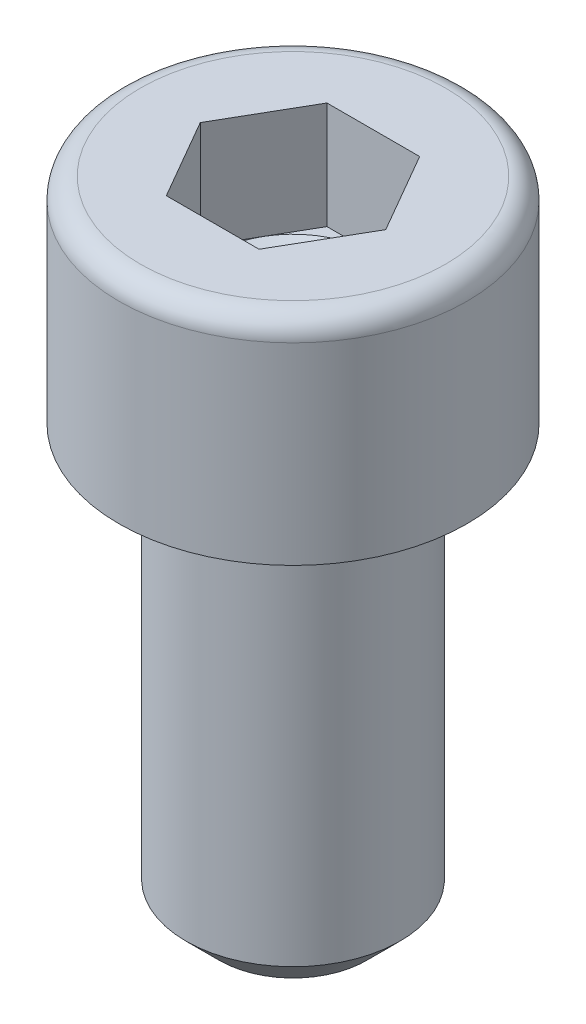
ISO-10303-21;
HEADER;
FILE_DESCRIPTION(('STEP AP214'),'2;1');
FILE_NAME('part.step','',(''),(''),'','','');
FILE_SCHEMA(('AUTOMOTIVE_DESIGN { 1 0 10303 214 1 1 1 1 }'));
ENDSEC;
DATA;
#1=APPLICATION_CONTEXT('core data for automotive mechanical design processes');
#2=APPLICATION_PROTOCOL_DEFINITION('international standard','automotive_design',2000,#1);
#3=PRODUCT_CONTEXT('',#1,'mechanical');
#4=PRODUCT('Part','Part','',(#3));
#5=PRODUCT_RELATED_PRODUCT_CATEGORY('part','',(#4));
#6=PRODUCT_DEFINITION_FORMATION('','',#4);
#7=PRODUCT_DEFINITION_CONTEXT('part definition',#1,'design');
#8=PRODUCT_DEFINITION('design','',#6,#7);
#9=PRODUCT_DEFINITION_SHAPE('','',#8);
#10=(LENGTH_UNIT() NAMED_UNIT(*) SI_UNIT(.MILLI.,.METRE.));
#11=(NAMED_UNIT(*) PLANE_ANGLE_UNIT() SI_UNIT($,.RADIAN.));
#12=(NAMED_UNIT(*) SI_UNIT($,.STERADIAN.) SOLID_ANGLE_UNIT());
#13=UNCERTAINTY_MEASURE_WITH_UNIT(LENGTH_MEASURE(1.E-05),#10,'distance_accuracy_value','');
#14=(GEOMETRIC_REPRESENTATION_CONTEXT(3) GLOBAL_UNCERTAINTY_ASSIGNED_CONTEXT((#13)) GLOBAL_UNIT_ASSIGNED_CONTEXT((#10,
#11,#12)) REPRESENTATION_CONTEXT('',''));
#15=CARTESIAN_POINT('',(0.,0.,0.));
#16=DIRECTION('',(0.,0.,1.));
#17=DIRECTION('',(1.,0.,0.));
#18=AXIS2_PLACEMENT_3D('',#15,#16,#17);
#19=CARTESIAN_POINT('',(3.,8.,0.));
#20=DIRECTION('',(0.,-1.,0.));
#21=DIRECTION('',(1.,0.,0.));
#22=AXIS2_PLACEMENT_3D('',#19,#20,#21);
#23=PLANE('',#22);
#24=CARTESIAN_POINT('',(0.,8.,0.));
#25=DIRECTION('',(0.,1.,0.));
#26=DIRECTION('',(-1.,0.,0.));
#27=AXIS2_PLACEMENT_3D('',#24,#25,#26);
#28=CIRCLE('',#27,5.7);
#29=CARTESIAN_POINT('',(-5.7,8.,0.));
#30=VERTEX_POINT('',#29);
#31=EDGE_CURVE('E141',#30,#30,#28,.T.);
#32=ORIENTED_EDGE('',*,*,#31,.T.);
#33=EDGE_LOOP('',(#32));
#34=FACE_BOUND('',#33,.T.);
#35=DIRECTION('',(0.499999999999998,0.,0.86602540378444));
#36=VECTOR('',#35,1.);
#37=CARTESIAN_POINT('',(1.73205080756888,8.,-3.));
#38=LINE('',#37,#36);
#39=CARTESIAN_POINT('',(1.73205080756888,8.,-3.));
#40=VERTEX_POINT('',#39);
#41=CARTESIAN_POINT('',(3.46410161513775,8.,0.));
#42=VERTEX_POINT('',#41);
#43=EDGE_CURVE('E373',#40,#42,#38,.T.);
#44=ORIENTED_EDGE('',*,*,#43,.T.);
#45=DIRECTION('',(-0.499999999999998,0.,0.86602540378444));
#46=VECTOR('',#45,1.);
#47=CARTESIAN_POINT('',(1.73205080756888,8.,3.));
#48=LINE('',#47,#46);
#49=CARTESIAN_POINT('',(1.73205080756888,8.,3.));
#50=VERTEX_POINT('',#49);
#51=EDGE_CURVE('E376',#42,#50,#48,.T.);
#52=ORIENTED_EDGE('',*,*,#51,.T.);
#53=DIRECTION('',(-1.,0.,0.));
#54=VECTOR('',#53,1.);
#55=CARTESIAN_POINT('',(1.73205080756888,8.,3.));
#56=LINE('',#55,#54);
#57=CARTESIAN_POINT('',(-1.73205080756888,8.,3.));
#58=VERTEX_POINT('',#57);
#59=EDGE_CURVE('E379',#50,#58,#56,.T.);
#60=ORIENTED_EDGE('',*,*,#59,.T.);
#61=DIRECTION('',(-0.499999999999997,0.,-0.86602540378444));
#62=VECTOR('',#61,1.);
#63=CARTESIAN_POINT('',(-1.73205080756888,8.,3.));
#64=LINE('',#63,#62);
#65=CARTESIAN_POINT('',(-3.46410161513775,8.,0.));
#66=VERTEX_POINT('',#65);
#67=EDGE_CURVE('E118',#58,#66,#64,.T.);
#68=ORIENTED_EDGE('',*,*,#67,.T.);
#69=DIRECTION('',(0.499999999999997,0.,-0.86602540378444));
#70=VECTOR('',#69,1.);
#71=CARTESIAN_POINT('',(-1.73205080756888,8.,-3.));
#72=LINE('',#71,#70);
#73=CARTESIAN_POINT('',(-1.73205080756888,8.,-3.));
#74=VERTEX_POINT('',#73);
#75=EDGE_CURVE('E370',#66,#74,#72,.T.);
#76=ORIENTED_EDGE('',*,*,#75,.T.);
#77=DIRECTION('',(1.,0.,0.));
#78=VECTOR('',#77,1.);
#79=CARTESIAN_POINT('',(1.73205080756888,8.,-3.));
#80=LINE('',#79,#78);
#81=EDGE_CURVE('E129',#74,#40,#80,.T.);
#82=ORIENTED_EDGE('',*,*,#81,.T.);
#83=EDGE_LOOP('',(#44,#52,#60,#68,#76,#82));
#84=FACE_BOUND('',#83,.T.);
#85=ADVANCED_FACE('F35',(#34,#84),#23,.F.);
#86=CARTESIAN_POINT('',(0.,-16.,0.));
#87=DIRECTION('',(0.,1.,0.));
#88=DIRECTION('',(0.,0.,1.));
#89=AXIS2_PLACEMENT_3D('',#86,#87,#88);
#90=CYLINDRICAL_SURFACE('',#89,4.);
#91=CARTESIAN_POINT('',(0.,-14.75,0.));
#92=DIRECTION('',(0.,1.,0.));
#93=DIRECTION('',(0.,0.,1.));
#94=AXIS2_PLACEMENT_3D('',#91,#92,#93);
#95=CIRCLE('',#94,4.);
#96=CARTESIAN_POINT('',(0.,-14.75,4.));
#97=VERTEX_POINT('',#96);
#98=EDGE_CURVE('E43',#97,#97,#95,.T.);
#99=ORIENTED_EDGE('',*,*,#98,.T.);
#100=EDGE_LOOP('',(#99));
#101=FACE_BOUND('',#100,.T.);
#102=CARTESIAN_POINT('',(0.,0.,0.));
#103=DIRECTION('',(0.,1.,0.));
#104=DIRECTION('',(0.,0.,1.));
#105=AXIS2_PLACEMENT_3D('',#102,#103,#104);
#106=CIRCLE('',#105,4.);
#107=CARTESIAN_POINT('',(0.,0.,4.));
#108=VERTEX_POINT('',#107);
#109=EDGE_CURVE('E151',#108,#108,#106,.T.);
#110=ORIENTED_EDGE('',*,*,#109,.F.);
#111=EDGE_LOOP('',(#110));
#112=FACE_BOUND('',#111,.T.);
#113=ADVANCED_FACE('F156',(#101,#112),#90,.T.);
#114=CARTESIAN_POINT('',(0.,-16.,0.));
#115=DIRECTION('',(0.,1.,0.));
#116=DIRECTION('',(0.,0.,1.));
#117=AXIS2_PLACEMENT_3D('',#114,#115,#116);
#118=PLANE('',#117);
#119=CARTESIAN_POINT('',(0.,-16.,0.));
#120=DIRECTION('',(0.,1.,0.));
#121=DIRECTION('',(0.,0.,1.));
#122=AXIS2_PLACEMENT_3D('',#119,#120,#121);
#123=CIRCLE('',#122,2.75);
#124=CARTESIAN_POINT('',(0.,-16.,2.75));
#125=VERTEX_POINT('',#124);
#126=EDGE_CURVE('E11',#125,#125,#123,.F.);
#127=ORIENTED_EDGE('',*,*,#126,.T.);
#128=EDGE_LOOP('',(#127));
#129=FACE_BOUND('',#128,.T.);
#130=ADVANCED_FACE('F161',(#129),#118,.F.);
#131=CARTESIAN_POINT('',(0.,-14.75,0.));
#132=DIRECTION('',(0.,1.,0.));
#133=DIRECTION('',(0.,0.,1.));
#134=AXIS2_PLACEMENT_3D('',#131,#132,#133);
#135=CONICAL_SURFACE('',#134,4.,0.785398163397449);
#136=ORIENTED_EDGE('',*,*,#126,.F.);
#137=EDGE_LOOP('',(#136));
#138=FACE_BOUND('',#137,.T.);
#139=ORIENTED_EDGE('',*,*,#98,.F.);
#140=EDGE_LOOP('',(#139));
#141=FACE_BOUND('',#140,.T.);
#142=ADVANCED_FACE('F37',(#138,#141),#135,.T.);
#143=CARTESIAN_POINT('',(0.,0.,0.));
#144=DIRECTION('',(0.,1.,0.));
#145=DIRECTION('',(-1.,0.,0.));
#146=AXIS2_PLACEMENT_3D('',#143,#144,#145);
#147=PLANE('',#146);
#148=ORIENTED_EDGE('',*,*,#109,.T.);
#149=EDGE_LOOP('',(#148));
#150=FACE_BOUND('',#149,.T.);
#151=CARTESIAN_POINT('',(0.,0.,0.));
#152=DIRECTION('',(0.,1.,0.));
#153=DIRECTION('',(-1.,0.,0.));
#154=AXIS2_PLACEMENT_3D('',#151,#152,#153);
#155=CIRCLE('',#154,6.5);
#156=CARTESIAN_POINT('',(-6.5,0.,0.));
#157=VERTEX_POINT('',#156);
#158=EDGE_CURVE('E148',#157,#157,#155,.T.);
#159=ORIENTED_EDGE('',*,*,#158,.F.);
#160=EDGE_LOOP('',(#159));
#161=FACE_BOUND('',#160,.T.);
#162=ADVANCED_FACE('F160',(#150,#161),#147,.F.);
#163=CARTESIAN_POINT('',(0.,8.,0.));
#164=DIRECTION('',(0.,1.,0.));
#165=DIRECTION('',(-1.,0.,0.));
#166=AXIS2_PLACEMENT_3D('',#163,#164,#165);
#167=CYLINDRICAL_SURFACE('',#166,6.5);
#168=CARTESIAN_POINT('',(0.,7.2,0.));
#169=DIRECTION('',(0.,1.,0.));
#170=DIRECTION('',(-1.,0.,0.));
#171=AXIS2_PLACEMENT_3D('',#168,#169,#170);
#172=CIRCLE('',#171,6.5);
#173=CARTESIAN_POINT('',(-6.5,7.2,0.));
#174=VERTEX_POINT('',#173);
#175=EDGE_CURVE('E145',#174,#174,#172,.T.);
#176=ORIENTED_EDGE('',*,*,#175,.F.);
#177=EDGE_LOOP('',(#176));
#178=FACE_BOUND('',#177,.T.);
#179=ORIENTED_EDGE('',*,*,#158,.T.);
#180=EDGE_LOOP('',(#179));
#181=FACE_BOUND('',#180,.T.);
#182=ADVANCED_FACE('F167',(#178,#181),#167,.T.);
#183=CARTESIAN_POINT('',(0.,7.2,0.));
#184=DIRECTION('',(0.,1.,0.));
#185=DIRECTION('',(-1.,0.,0.));
#186=AXIS2_PLACEMENT_3D('',#183,#184,#185);
#187=TOROIDAL_SURFACE('',#186,5.7,0.8);
#188=ORIENTED_EDGE('',*,*,#31,.F.);
#189=EDGE_LOOP('',(#188));
#190=FACE_BOUND('',#189,.T.);
#191=ORIENTED_EDGE('',*,*,#175,.T.);
#192=EDGE_LOOP('',(#191));
#193=FACE_BOUND('',#192,.T.);
#194=ADVANCED_FACE('F184',(#190,#193),#187,.T.);
#195=CARTESIAN_POINT('',(-1.73205080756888,4.,-3.));
#196=DIRECTION('',(0.86602540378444,0.,0.499999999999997));
#197=DIRECTION('',(0.499999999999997,0.,-0.86602540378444));
#198=AXIS2_PLACEMENT_3D('',#195,#196,#197);
#199=PLANE('',#198);
#200=ORIENTED_EDGE('',*,*,#75,.F.);
#201=DIRECTION('',(0.,1.,0.));
#202=VECTOR('',#201,1.);
#203=CARTESIAN_POINT('',(-3.46410161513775,4.,0.));
#204=LINE('',#203,#202);
#205=CARTESIAN_POINT('',(-3.46410161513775,4.,0.));
#206=VERTEX_POINT('',#205);
#207=EDGE_CURVE('E365',#206,#66,#204,.T.);
#208=ORIENTED_EDGE('',*,*,#207,.F.);
#209=DIRECTION('',(0.499999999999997,0.,-0.86602540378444));
#210=VECTOR('',#209,1.);
#211=CARTESIAN_POINT('',(-1.73205080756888,4.,-3.));
#212=LINE('',#211,#210);
#213=CARTESIAN_POINT('',(-2.59807621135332,4.,-1.49999999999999));
#214=VERTEX_POINT('',#213);
#215=EDGE_CURVE('E114',#206,#214,#212,.T.);
#216=ORIENTED_EDGE('',*,*,#215,.T.);
#217=CARTESIAN_POINT('',(-1.73205080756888,4.,-3.));
#218=VERTEX_POINT('',#217);
#219=EDGE_CURVE('E108',#214,#218,#212,.T.);
#220=ORIENTED_EDGE('',*,*,#219,.T.);
#221=DIRECTION('',(0.,1.,0.));
#222=VECTOR('',#221,1.);
#223=CARTESIAN_POINT('',(-1.73205080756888,4.,-3.));
#224=LINE('',#223,#222);
#225=EDGE_CURVE('E110',#218,#74,#224,.T.);
#226=ORIENTED_EDGE('',*,*,#225,.T.);
#227=EDGE_LOOP('',(#200,#208,#216,#220,#226));
#228=FACE_BOUND('',#227,.T.);
#229=ADVANCED_FACE('F109',(#228),#199,.T.);
#230=CARTESIAN_POINT('',(1.73205080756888,4.,-3.));
#231=DIRECTION('',(0.,0.,1.));
#232=DIRECTION('',(1.,0.,0.));
#233=AXIS2_PLACEMENT_3D('',#230,#231,#232);
#234=PLANE('',#233);
#235=ORIENTED_EDGE('',*,*,#81,.F.);
#236=ORIENTED_EDGE('',*,*,#225,.F.);
#237=DIRECTION('',(1.,0.,0.));
#238=VECTOR('',#237,1.);
#239=CARTESIAN_POINT('',(1.73205080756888,4.,-3.));
#240=LINE('',#239,#238);
#241=CARTESIAN_POINT('',(0.,4.,-3.));
#242=VERTEX_POINT('',#241);
#243=EDGE_CURVE('E50',#218,#242,#240,.T.);
#244=ORIENTED_EDGE('',*,*,#243,.T.);
#245=CARTESIAN_POINT('',(1.73205080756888,4.,-3.));
#246=VERTEX_POINT('',#245);
#247=EDGE_CURVE('E124',#242,#246,#240,.T.);
#248=ORIENTED_EDGE('',*,*,#247,.T.);
#249=DIRECTION('',(0.,1.,0.));
#250=VECTOR('',#249,1.);
#251=CARTESIAN_POINT('',(1.73205080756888,4.,-3.));
#252=LINE('',#251,#250);
#253=EDGE_CURVE('E131',#246,#40,#252,.T.);
#254=ORIENTED_EDGE('',*,*,#253,.T.);
#255=EDGE_LOOP('',(#235,#236,#244,#248,#254));
#256=FACE_BOUND('',#255,.T.);
#257=ADVANCED_FACE('F126',(#256),#234,.T.);
#258=CARTESIAN_POINT('',(1.73205080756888,4.,-3.));
#259=DIRECTION('',(-0.86602540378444,0.,0.499999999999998));
#260=DIRECTION('',(0.499999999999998,0.,0.86602540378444));
#261=AXIS2_PLACEMENT_3D('',#258,#259,#260);
#262=PLANE('',#261);
#263=ORIENTED_EDGE('',*,*,#43,.F.);
#264=ORIENTED_EDGE('',*,*,#253,.F.);
#265=DIRECTION('',(0.499999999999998,0.,0.86602540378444));
#266=VECTOR('',#265,1.);
#267=CARTESIAN_POINT('',(1.73205080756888,4.,-3.));
#268=LINE('',#267,#266);
#269=CARTESIAN_POINT('',(2.59807621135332,4.,-1.49999999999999));
#270=VERTEX_POINT('',#269);
#271=EDGE_CURVE('E398',#246,#270,#268,.T.);
#272=ORIENTED_EDGE('',*,*,#271,.T.);
#273=CARTESIAN_POINT('',(3.46410161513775,4.,0.));
#274=VERTEX_POINT('',#273);
#275=EDGE_CURVE('E123',#270,#274,#268,.T.);
#276=ORIENTED_EDGE('',*,*,#275,.T.);
#277=DIRECTION('',(0.,1.,0.));
#278=VECTOR('',#277,1.);
#279=CARTESIAN_POINT('',(3.46410161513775,4.,0.));
#280=LINE('',#279,#278);
#281=EDGE_CURVE('E136',#274,#42,#280,.T.);
#282=ORIENTED_EDGE('',*,*,#281,.T.);
#283=EDGE_LOOP('',(#263,#264,#272,#276,#282));
#284=FACE_BOUND('',#283,.T.);
#285=ADVANCED_FACE('F214',(#284),#262,.T.);
#286=CARTESIAN_POINT('',(1.73205080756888,4.,3.));
#287=DIRECTION('',(-0.86602540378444,0.,-0.499999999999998));
#288=DIRECTION('',(-0.499999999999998,0.,0.86602540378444));
#289=AXIS2_PLACEMENT_3D('',#286,#287,#288);
#290=PLANE('',#289);
#291=ORIENTED_EDGE('',*,*,#51,.F.);
#292=ORIENTED_EDGE('',*,*,#281,.F.);
#293=DIRECTION('',(-0.499999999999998,0.,0.86602540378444));
#294=VECTOR('',#293,1.);
#295=CARTESIAN_POINT('',(1.73205080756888,4.,3.));
#296=LINE('',#295,#294);
#297=CARTESIAN_POINT('',(2.59807621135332,4.,1.49999999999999));
#298=VERTEX_POINT('',#297);
#299=EDGE_CURVE('E396',#274,#298,#296,.T.);
#300=ORIENTED_EDGE('',*,*,#299,.T.);
#301=CARTESIAN_POINT('',(1.73205080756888,4.,3.));
#302=VERTEX_POINT('',#301);
#303=EDGE_CURVE('E397',#298,#302,#296,.T.);
#304=ORIENTED_EDGE('',*,*,#303,.T.);
#305=DIRECTION('',(0.,1.,0.));
#306=VECTOR('',#305,1.);
#307=CARTESIAN_POINT('',(1.73205080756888,4.,3.));
#308=LINE('',#307,#306);
#309=EDGE_CURVE('E385',#302,#50,#308,.T.);
#310=ORIENTED_EDGE('',*,*,#309,.T.);
#311=EDGE_LOOP('',(#291,#292,#300,#304,#310));
#312=FACE_BOUND('',#311,.T.);
#313=ADVANCED_FACE('F221',(#312),#290,.T.);
#314=CARTESIAN_POINT('',(1.73205080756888,4.,3.));
#315=DIRECTION('',(0.,0.,-1.));
#316=DIRECTION('',(-1.,0.,0.));
#317=AXIS2_PLACEMENT_3D('',#314,#315,#316);
#318=PLANE('',#317);
#319=ORIENTED_EDGE('',*,*,#59,.F.);
#320=ORIENTED_EDGE('',*,*,#309,.F.);
#321=DIRECTION('',(-1.,0.,0.));
#322=VECTOR('',#321,1.);
#323=CARTESIAN_POINT('',(1.73205080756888,4.,3.));
#324=LINE('',#323,#322);
#325=CARTESIAN_POINT('',(0.,4.,3.));
#326=VERTEX_POINT('',#325);
#327=EDGE_CURVE('E360',#302,#326,#324,.T.);
#328=ORIENTED_EDGE('',*,*,#327,.T.);
#329=CARTESIAN_POINT('',(-1.73205080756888,4.,3.));
#330=VERTEX_POINT('',#329);
#331=EDGE_CURVE('E356',#326,#330,#324,.T.);
#332=ORIENTED_EDGE('',*,*,#331,.T.);
#333=DIRECTION('',(0.,1.,0.));
#334=VECTOR('',#333,1.);
#335=CARTESIAN_POINT('',(-1.73205080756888,4.,3.));
#336=LINE('',#335,#334);
#337=EDGE_CURVE('E364',#330,#58,#336,.T.);
#338=ORIENTED_EDGE('',*,*,#337,.T.);
#339=EDGE_LOOP('',(#319,#320,#328,#332,#338));
#340=FACE_BOUND('',#339,.T.);
#341=ADVANCED_FACE('F229',(#340),#318,.T.);
#342=CARTESIAN_POINT('',(-1.73205080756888,4.,3.));
#343=DIRECTION('',(0.86602540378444,0.,-0.499999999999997));
#344=DIRECTION('',(-0.499999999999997,0.,-0.86602540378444));
#345=AXIS2_PLACEMENT_3D('',#342,#343,#344);
#346=PLANE('',#345);
#347=ORIENTED_EDGE('',*,*,#67,.F.);
#348=ORIENTED_EDGE('',*,*,#337,.F.);
#349=DIRECTION('',(-0.499999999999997,0.,-0.86602540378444));
#350=VECTOR('',#349,1.);
#351=CARTESIAN_POINT('',(-1.73205080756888,4.,3.));
#352=LINE('',#351,#350);
#353=CARTESIAN_POINT('',(-2.59807621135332,4.,1.49999999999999));
#354=VERTEX_POINT('',#353);
#355=EDGE_CURVE('E355',#330,#354,#352,.T.);
#356=ORIENTED_EDGE('',*,*,#355,.T.);
#357=EDGE_CURVE('E358',#354,#206,#352,.T.);
#358=ORIENTED_EDGE('',*,*,#357,.T.);
#359=ORIENTED_EDGE('',*,*,#207,.T.);
#360=EDGE_LOOP('',(#347,#348,#356,#358,#359));
#361=FACE_BOUND('',#360,.T.);
#362=ADVANCED_FACE('F237',(#361),#346,.T.);
#363=CARTESIAN_POINT('',(-5.19615242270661,4.,3.));
#364=DIRECTION('',(0.,-1.,0.));
#365=DIRECTION('',(0.,0.,-1.));
#366=AXIS2_PLACEMENT_3D('',#363,#364,#365);
#367=PLANE('',#366);
#368=ORIENTED_EDGE('',*,*,#243,.F.);
#369=ORIENTED_EDGE('',*,*,#219,.F.);
#370=CARTESIAN_POINT('',(0.,4.,0.));
#371=DIRECTION('',(0.,1.,0.));
#372=DIRECTION('',(-1.,0.,0.));
#373=AXIS2_PLACEMENT_3D('',#370,#371,#372);
#374=CIRCLE('',#373,3.);
#375=EDGE_CURVE('E121',#242,#214,#374,.T.);
#376=ORIENTED_EDGE('',*,*,#375,.F.);
#377=EDGE_LOOP('',(#368,#369,#376));
#378=FACE_BOUND('',#377,.T.);
#379=ADVANCED_FACE('F120',(#378),#367,.F.);
#380=ORIENTED_EDGE('',*,*,#215,.F.);
#381=ORIENTED_EDGE('',*,*,#357,.F.);
#382=EDGE_CURVE('E130',#214,#354,#374,.T.);
#383=ORIENTED_EDGE('',*,*,#382,.F.);
#384=EDGE_LOOP('',(#380,#381,#383));
#385=FACE_BOUND('',#384,.T.);
#386=ADVANCED_FACE('F252',(#385),#367,.F.);
#387=ORIENTED_EDGE('',*,*,#355,.F.);
#388=ORIENTED_EDGE('',*,*,#331,.F.);
#389=EDGE_CURVE('E135',#354,#326,#374,.T.);
#390=ORIENTED_EDGE('',*,*,#389,.F.);
#391=EDGE_LOOP('',(#387,#388,#390));
#392=FACE_BOUND('',#391,.T.);
#393=ADVANCED_FACE('F260',(#392),#367,.F.);
#394=ORIENTED_EDGE('',*,*,#327,.F.);
#395=ORIENTED_EDGE('',*,*,#303,.F.);
#396=EDGE_CURVE('E142',#326,#298,#374,.T.);
#397=ORIENTED_EDGE('',*,*,#396,.F.);
#398=EDGE_LOOP('',(#394,#395,#397));
#399=FACE_BOUND('',#398,.T.);
#400=ADVANCED_FACE('F267',(#399),#367,.F.);
#401=ORIENTED_EDGE('',*,*,#299,.F.);
#402=ORIENTED_EDGE('',*,*,#275,.F.);
#403=EDGE_CURVE('E402',#298,#270,#374,.T.);
#404=ORIENTED_EDGE('',*,*,#403,.F.);
#405=EDGE_LOOP('',(#401,#402,#404));
#406=FACE_BOUND('',#405,.T.);
#407=ADVANCED_FACE('F274',(#406),#367,.F.);
#408=ORIENTED_EDGE('',*,*,#271,.F.);
#409=ORIENTED_EDGE('',*,*,#247,.F.);
#410=EDGE_CURVE('E401',#270,#242,#374,.T.);
#411=ORIENTED_EDGE('',*,*,#410,.F.);
#412=EDGE_LOOP('',(#408,#409,#411));
#413=FACE_BOUND('',#412,.T.);
#414=ADVANCED_FACE('F254',(#413),#367,.F.);
#415=CARTESIAN_POINT('',(0.,4.,0.));
#416=DIRECTION('',(0.,1.,0.));
#417=DIRECTION('',(-1.,0.,0.));
#418=AXIS2_PLACEMENT_3D('',#415,#416,#417);
#419=CONICAL_SURFACE('',#418,3.,1.04719755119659);
#420=CARTESIAN_POINT('',(0.,2.2679491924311,0.));
#421=VERTEX_POINT('',#420);
#422=VERTEX_LOOP('',#421);
#423=FACE_BOUND('',#422,.T.);
#424=ORIENTED_EDGE('',*,*,#389,.T.);
#425=ORIENTED_EDGE('',*,*,#396,.T.);
#426=ORIENTED_EDGE('',*,*,#403,.T.);
#427=ORIENTED_EDGE('',*,*,#410,.T.);
#428=ORIENTED_EDGE('',*,*,#375,.T.);
#429=ORIENTED_EDGE('',*,*,#382,.T.);
#430=EDGE_LOOP('',(#424,#425,#426,#427,#428,#429));
#431=FACE_BOUND('',#430,.T.);
#432=ADVANCED_FACE('F182',(#423,#431),#419,.F.);
#433=CLOSED_SHELL('',(#85,#113,#130,#142,#162,#182,#194,#229,#257,#285,#313,#341,#362,#379,#386,
#393,#400,#407,#414,#432));
#434=MANIFOLD_SOLID_BREP('B2',#433);
#435=ADVANCED_BREP_SHAPE_REPRESENTATION('',(#18,#434),#14);
#436=SHAPE_DEFINITION_REPRESENTATION(#9,#435);
ENDSEC;
END-ISO-10303-21;
